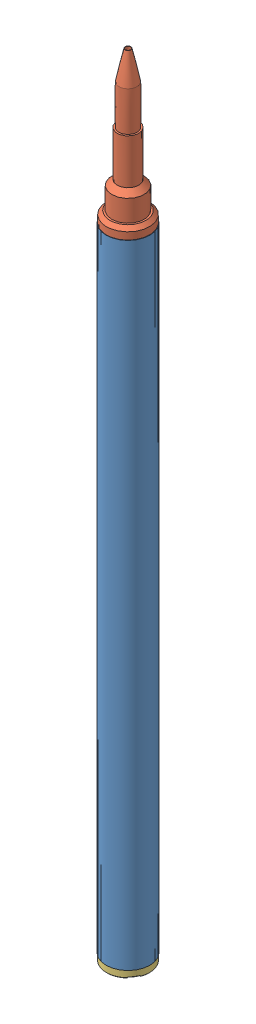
SolidWorks assembly Ink Cartridge Assembly.SLDASM, configuration Default (file format 7000). Lengths in mm.
Overall size (8.3 110 8.3).
3 component instances, 3 part files, 4 mates.
Components (placement in the parent):
- Ink Cartridge-1: Ink Cartridge.SLDPRT [Default] at origin size (6.1 88 6.1)
- Pen Point-1: Pen Point.SLDPRT [Default] at (0 83 0) size (6 26 6)
- Ink Cartridge Cap-1: Ink Cartridge Cap.SLDPRT [Default] x (-0.837169 0 -0.546944) z (-0.546944 0 0.837169) size (6 5 6)
Mates (geometry in assembly coordinates):
- Coincident2: coincident anti-aligned: plane of Ink Cartridge-1 through (0 0 0) normal (0 -1 0); plane of Ink Cartridge Cap-1 through (0 0 0) normal (0 1 0)
- Concentric2: concentric aligned: cylinder of Ink Cartridge-1 through (0 88 0) axis (0 -1 0) radius 2.55; circle of Ink Cartridge Cap-1
- Concentric3: concentric aligned: cylinder of Ink Cartridge-1 through (0 88 0) axis (0 -1 0) radius 2.55; cylinder of Pen Point-1 through (0 88 0) axis (0 -1 0) radius 2.5
- Coincident3: coincident anti-aligned: plane of Ink Cartridge-1 through (0 88 0) normal (0 1 0); plane of Pen Point-1 through (0 88 0) normal (0 -1 0)
